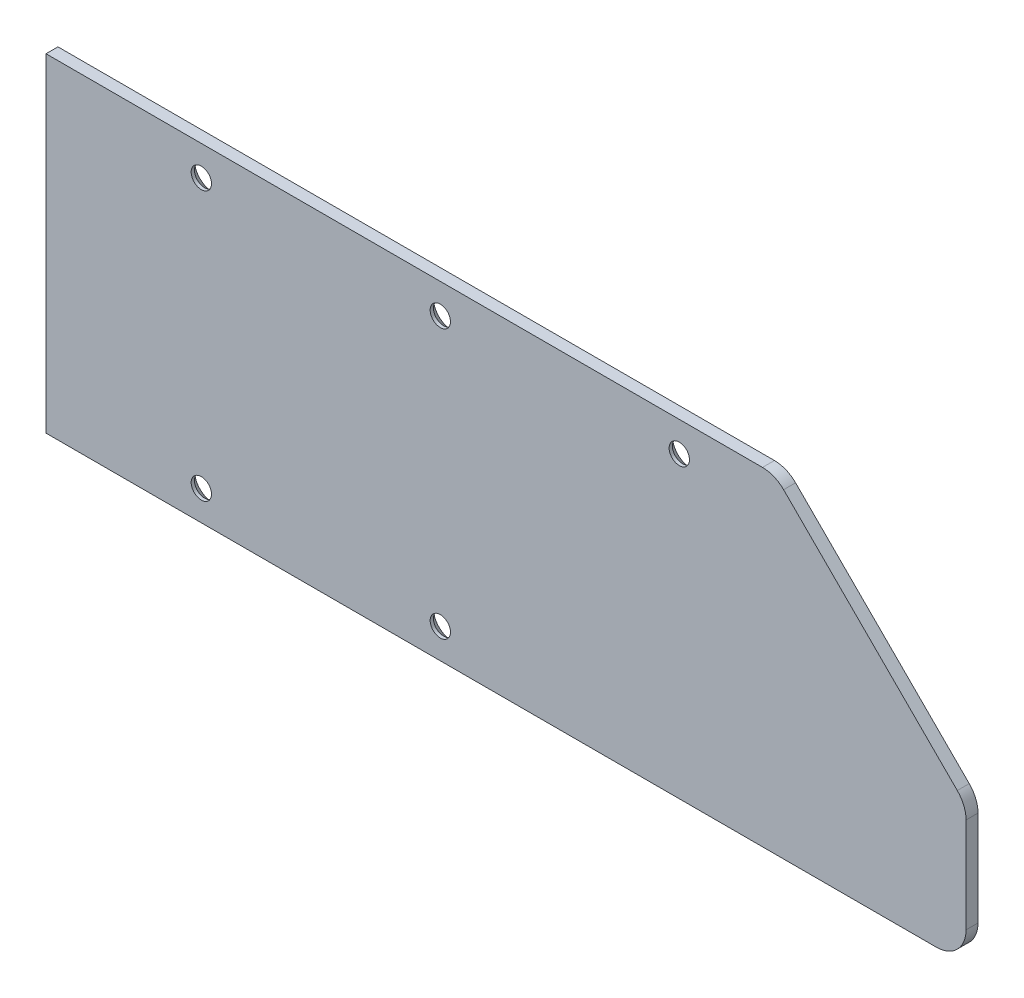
from build123d import *

# Parameters (mm, degrees)
ESQUISSE1_W                     = 154
ESQUISSE1_H                     = 55
EXTRUSION1_DEPTH                = 2
ENL_V_MAT_EXTRU_1_DEPTH         = 164.538986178
ENL_V_MAT_EXTRU_1_DEPTH_BACK    = 164.538986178
CONG_1_R                        = 5
R_P_TITION_LIN_AIRE1_COUNT      = 3
R_P_TITION_LIN_AIRE1_PITCH      = 40
R_P_TITION_LIN_AIRE1_COUNT_DIR2 = 2
R_P_TITION_LIN_AIRE1_PITCH_DIR2 = 45


with BuildPart() as part:
    # Esquisse1 → Extrusion1 (new body)
    with BuildSketch(Plane.XY):
        with Locations((77, 27.5)):
            Rectangle(ESQUISSE1_W, ESQUISSE1_H)
    extrude(amount=EXTRUSION1_DEPTH)

    # Esquisse2 → Enl_v. mat.-Extru.1 (cut, two sides: drawn at the far end of the back side and taken through both)
    with BuildSketch(Plane.XY.offset(2).offset(-ENL_V_MAT_EXTRU_1_DEPTH_BACK)):
        Polygon((-107.512071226, 284.512071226), (122, 55), (154, 23), (383.512071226, -206.512071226), (842.536213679, 252.512071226), (351.512071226, 743.536213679), align=None)
    extrude(amount=ENL_V_MAT_EXTRU_1_DEPTH + ENL_V_MAT_EXTRU_1_DEPTH_BACK, mode=Mode.SUBTRACT)

    # Cong_1
    cong_1_edges = [part.edges().sort_by_distance(p)[0] for p in [
        (154, 23, 1),
        (122, 55, 1),
        (154, 0, 1),
    ]]
    fillet(cong_1_edges, radius=CONG_1_R)

    # Esquisse3 → Fraisage pour vis _ t_te frais_e M31 (revolve, cut)
    with BuildSketch(Plane(origin=(26, 5, 0), x_dir=(0, 1, 0), z_dir=(1, 0, 0))):
        Polygon((0, 0), (0, 2), (1.7, 2), (1.7, 1.45), (3.15, 0), align=None)
    fraisage_pour_vis_t_te_frais_e_m31 = revolve(axis=Axis((26, 5, -6.35), (0, 0, 1)), mode=Mode.SUBTRACT)

    # R_p_tition lin_aire1: Fraisage pour vis _ t_te frais_e M31 3 × 2, 1 skipped
    with Locations(*[(i * R_P_TITION_LIN_AIRE1_PITCH, j * R_P_TITION_LIN_AIRE1_PITCH_DIR2, 0) for i in range(R_P_TITION_LIN_AIRE1_COUNT) for j in range(R_P_TITION_LIN_AIRE1_COUNT_DIR2) if (i, j) not in ((0, 0), (2, 0))]):
        add(fraisage_pour_vis_t_te_frais_e_m31, mode=Mode.SUBTRACT)


solid = part.part
